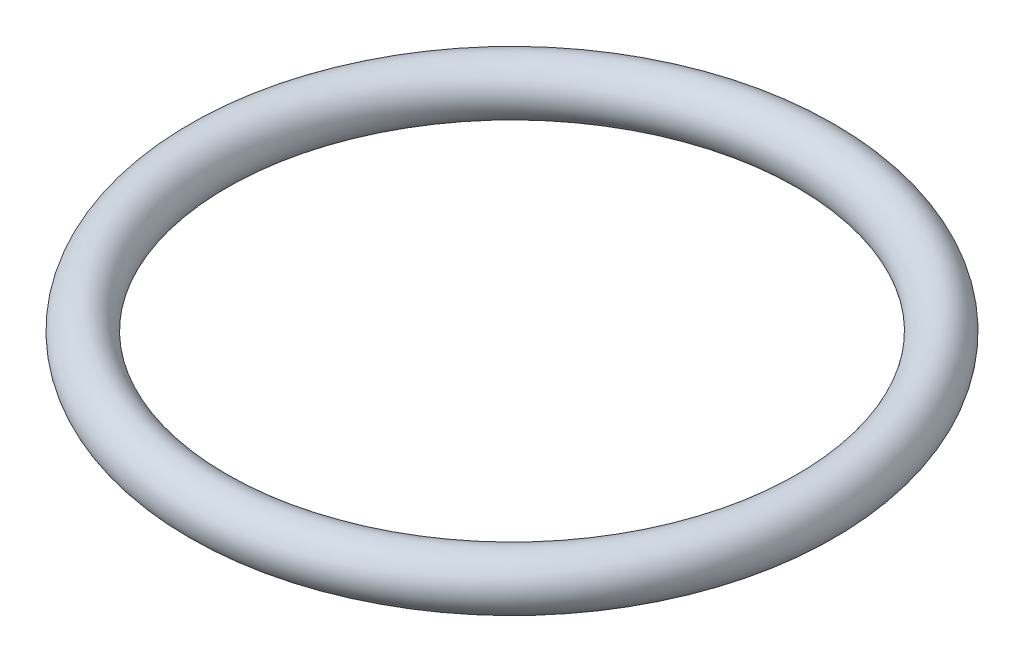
ISO-10303-21;
HEADER;
FILE_DESCRIPTION(('STEP AP214'),'2;1');
FILE_NAME('part.step','',(''),(''),'','','');
FILE_SCHEMA(('AUTOMOTIVE_DESIGN { 1 0 10303 214 1 1 1 1 }'));
ENDSEC;
DATA;
#1=APPLICATION_CONTEXT('core data for automotive mechanical design processes');
#2=APPLICATION_PROTOCOL_DEFINITION('international standard','automotive_design',2000,#1);
#3=PRODUCT_CONTEXT('',#1,'mechanical');
#4=PRODUCT('Part','Part','',(#3));
#5=PRODUCT_RELATED_PRODUCT_CATEGORY('part','',(#4));
#6=PRODUCT_DEFINITION_FORMATION('','',#4);
#7=PRODUCT_DEFINITION_CONTEXT('part definition',#1,'design');
#8=PRODUCT_DEFINITION('design','',#6,#7);
#9=PRODUCT_DEFINITION_SHAPE('','',#8);
#10=(LENGTH_UNIT() NAMED_UNIT(*) SI_UNIT(.MILLI.,.METRE.));
#11=(NAMED_UNIT(*) PLANE_ANGLE_UNIT() SI_UNIT($,.RADIAN.));
#12=(NAMED_UNIT(*) SI_UNIT($,.STERADIAN.) SOLID_ANGLE_UNIT());
#13=UNCERTAINTY_MEASURE_WITH_UNIT(LENGTH_MEASURE(1.E-05),#10,'distance_accuracy_value','');
#14=(GEOMETRIC_REPRESENTATION_CONTEXT(3) GLOBAL_UNCERTAINTY_ASSIGNED_CONTEXT((#13)) GLOBAL_UNIT_ASSIGNED_CONTEXT((#10,
#11,#12)) REPRESENTATION_CONTEXT('',''));
#15=CARTESIAN_POINT('',(0.,0.,0.));
#16=DIRECTION('',(0.,0.,1.));
#17=DIRECTION('',(1.,0.,0.));
#18=AXIS2_PLACEMENT_3D('',#15,#16,#17);
#19=CARTESIAN_POINT('',(0.,0.,0.));
#20=DIRECTION('',(0.,1.,0.));
#21=DIRECTION('',(0.,0.,1.));
#22=AXIS2_PLACEMENT_3D('',#19,#20,#21);
#23=TOROIDAL_SURFACE('',#22,17.5,1.5);
#24=CARTESIAN_POINT('',(0.,0.,19.));
#25=VERTEX_POINT('',#24);
#26=VERTEX_LOOP('',#25);
#27=FACE_BOUND('',#26,.T.);
#28=ADVANCED_FACE('F32',(#27),#23,.T.);
#29=CLOSED_SHELL('',(#28));
#30=MANIFOLD_SOLID_BREP('B2',#29);
#31=ADVANCED_BREP_SHAPE_REPRESENTATION('',(#18,#30),#14);
#32=SHAPE_DEFINITION_REPRESENTATION(#9,#31);
ENDSEC;
END-ISO-10303-21;
